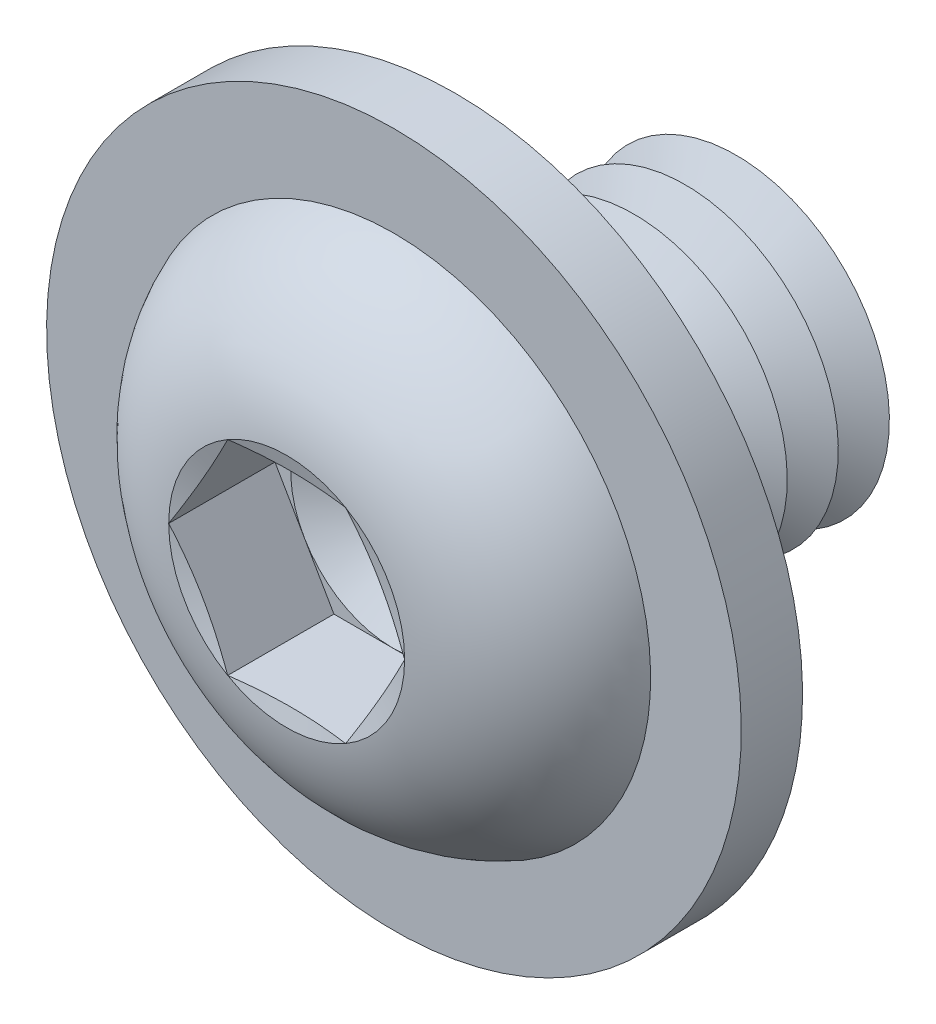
from build123d import *

# Parameters (mm, degrees)
FILLET1_R           = 0.5
LPATTERN1_COUNT     = 6
LPATTERN1_PITCH     = 1
CUT_EXTRUDE1_DEPTH  = 2.08
SKETCH5_R           = 6.8
SKETCH5_R_2         = 3.5
BOSS_EXTRUDE1_DEPTH = 1.2


with BuildPart() as part:
    # Sketch1 → Revolve1 (revolve)
    with BuildSketch(Plane(origin=(0, 0, 0), x_dir=(0, 0, -1), z_dir=(1, 0, 0))):
        with BuildLine():
            Line((0, 3), (0, 5.25))
            ThreePointArc((0, 5.25), (-2.210041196, 4.408189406), (-3.3, 2.3094))
            Line((-3.3, 2.3094), (-2.990599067, 1.1547))
            Line((-2.990599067, 1.1547), (-3.3, 1.1547))
            Line((-3.3, 1.1547), (-3.3, 0))
            Line((-3.3, 0), (6, 0))
            Line((6, 0), (6, 3))
            Line((6, 3), (0, 3))
        make_face()
    revolve(axis=Axis((0, 0, -6), (0, 0, 1)))

    # Fillet1
    fillet1_edges = [part.edges().sort_by_distance(p)[0] for p in [
        (0, -3, 0),
    ]]
    fillet(fillet1_edges, radius=FILLET1_R)

    # Sketch2 → Cut-Revolve1 (revolve, cut)
    with BuildSketch(Plane(origin=(0, 0, 0), x_dir=(0, 0, -1), z_dir=(1, 0, 0))):
        Polygon((5.5, 3), (6.5, 3), (6, 2.133974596), align=None)
    cut_revolve1 = revolve(axis=Axis((0, 0, -6), (0, 0, -1)), mode=Mode.SUBTRACT)

    # LPattern1: Cut-Revolve1 ×6
    with Locations(*[(0, 0, i * LPATTERN1_PITCH) for i in range(1, LPATTERN1_COUNT)]):
        add(cut_revolve1, mode=Mode.SUBTRACT)

    # Sketch3 → Cut-Extrude1 (cut)
    with BuildSketch(Plane.XY.offset(3.3)):
        Polygon((1.1547, 1.999999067), (-1.1547, 1.999999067), (-2.3094, 0), (-1.1547, -1.999999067), (1.1547, -1.999999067), (2.3094, 0), align=None)
    extrude(amount=-CUT_EXTRUDE1_DEPTH, mode=Mode.SUBTRACT)

    # Cut-Extrude2 cone 1 section (on through the dimple's axis) → Cut-Extrude2 (revolve, cut)
    with BuildSketch(Plane(origin=(0, 0, 1.22), x_dir=(0, -1, 0), z_dir=(1, 0, 0))):
        Polygon((0, 0), (1.999999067, 0), (0, 1.1547), align=None)
    revolve(axis=Axis((0, 0, 1.22), (0, 0, -1)), mode=Mode.SUBTRACT)

    # Sketch5 → Boss-Extrude1 (add)
    with BuildSketch(Plane(origin=(0, 0, 0), x_dir=(-1, 0, 0), z_dir=(0, 0, -1))):
        with Locations(Location((0, 0, 0), (0, 0, 90))):
            Circle(SKETCH5_R)
        Circle(SKETCH5_R_2, mode=Mode.SUBTRACT)
    extrude(amount=-BOSS_EXTRUDE1_DEPTH)


solid = part.part
